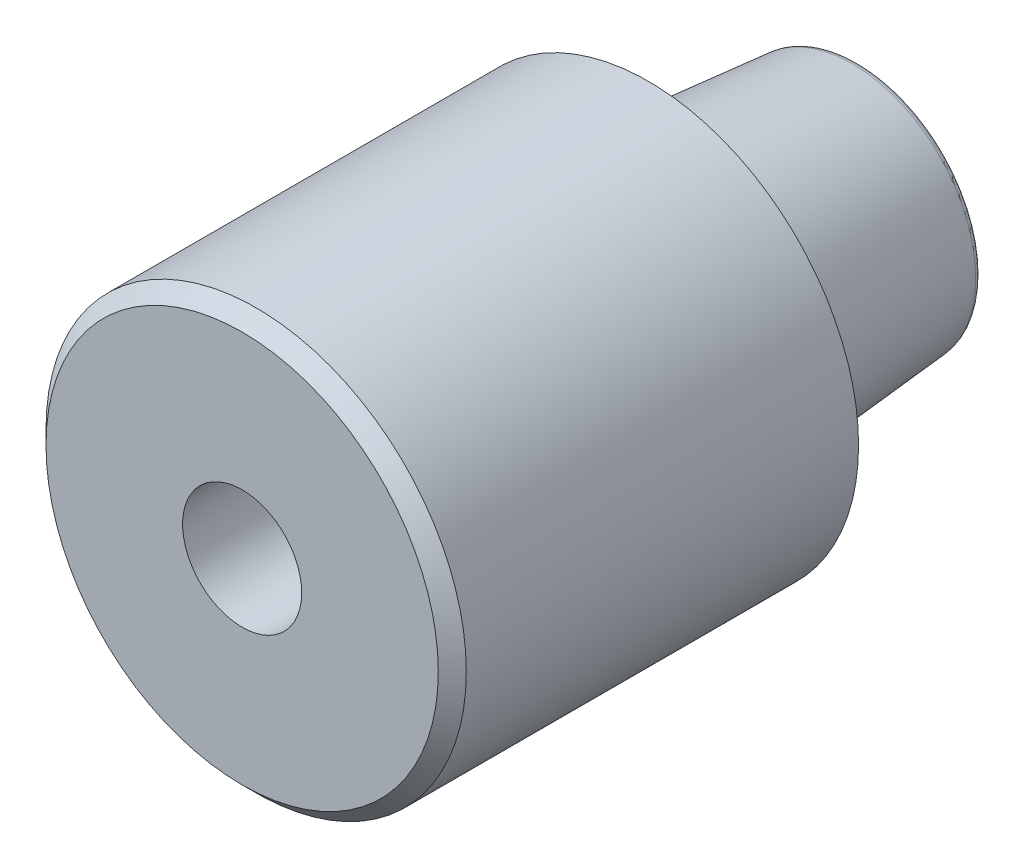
ISO-10303-21;
HEADER;
FILE_DESCRIPTION(('STEP AP214'),'2;1');
FILE_NAME('part.step','',(''),(''),'','','');
FILE_SCHEMA(('AUTOMOTIVE_DESIGN { 1 0 10303 214 1 1 1 1 }'));
ENDSEC;
DATA;
#1=APPLICATION_CONTEXT('core data for automotive mechanical design processes');
#2=APPLICATION_PROTOCOL_DEFINITION('international standard','automotive_design',2000,#1);
#3=PRODUCT_CONTEXT('',#1,'mechanical');
#4=PRODUCT('Part','Part','',(#3));
#5=PRODUCT_RELATED_PRODUCT_CATEGORY('part','',(#4));
#6=PRODUCT_DEFINITION_FORMATION('','',#4);
#7=PRODUCT_DEFINITION_CONTEXT('part definition',#1,'design');
#8=PRODUCT_DEFINITION('design','',#6,#7);
#9=PRODUCT_DEFINITION_SHAPE('','',#8);
#10=(LENGTH_UNIT() NAMED_UNIT(*) SI_UNIT(.MILLI.,.METRE.));
#11=(NAMED_UNIT(*) PLANE_ANGLE_UNIT() SI_UNIT($,.RADIAN.));
#12=(NAMED_UNIT(*) SI_UNIT($,.STERADIAN.) SOLID_ANGLE_UNIT());
#13=UNCERTAINTY_MEASURE_WITH_UNIT(LENGTH_MEASURE(1.E-05),#10,'distance_accuracy_value','');
#14=(GEOMETRIC_REPRESENTATION_CONTEXT(3) GLOBAL_UNCERTAINTY_ASSIGNED_CONTEXT((#13)) GLOBAL_UNIT_ASSIGNED_CONTEXT((#10,
#11,#12)) REPRESENTATION_CONTEXT('',''));
#15=CARTESIAN_POINT('',(0.,0.,0.));
#16=DIRECTION('',(0.,0.,1.));
#17=DIRECTION('',(1.,0.,0.));
#18=AXIS2_PLACEMENT_3D('',#15,#16,#17);
#19=CARTESIAN_POINT('',(1.5911934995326E-13,0.,22.7867965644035));
#20=DIRECTION('',(0.,0.,-1.));
#21=DIRECTION('',(1.,0.,0.));
#22=AXIS2_PLACEMENT_3D('',#19,#20,#21);
#23=CONICAL_SURFACE('',#22,21.2132034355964,0.785398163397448);
#24=CARTESIAN_POINT('',(2.09488880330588E-13,0.,30.));
#25=DIRECTION('',(0.,0.,-1.));
#26=DIRECTION('',(-1.,0.,0.));
#27=AXIS2_PLACEMENT_3D('',#24,#25,#26);
#28=CIRCLE('',#27,14.);
#29=CARTESIAN_POINT('',(-13.9999999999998,0.,30.));
#30=VERTEX_POINT('',#29);
#31=CARTESIAN_POINT('',(14.0000000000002,0.,30.));
#32=VERTEX_POINT('',#31);
#33=EDGE_CURVE('E59',#30,#32,#28,.T.);
#34=ORIENTED_EDGE('',*,*,#33,.T.);
#35=CARTESIAN_POINT('',(14.0000009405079,0.,29.9999990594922));
#36=CARTESIAN_POINT('',(15.0000023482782,0.,28.9999976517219));
#37=B_SPLINE_CURVE_WITH_KNOTS('',1,(#35,#36),.UNSPECIFIED.,.F.,.F.,(2,2),(0.659966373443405,
0.707106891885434),.UNSPECIFIED.);
#38=CARTESIAN_POINT('',(15.,0.,29.));
#39=VERTEX_POINT('',#38);
#40=EDGE_CURVE('E46',#32,#39,#37,.T.);
#41=ORIENTED_EDGE('',*,*,#40,.T.);
#42=CARTESIAN_POINT('',(2.02505917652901E-13,0.,29.));
#43=DIRECTION('',(0.,0.,1.));
#44=DIRECTION('',(-1.,0.,0.));
#45=AXIS2_PLACEMENT_3D('',#42,#43,#44);
#46=CIRCLE('',#45,15.);
#47=CARTESIAN_POINT('',(-14.9999999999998,0.,29.));
#48=VERTEX_POINT('',#47);
#49=EDGE_CURVE('E97',#39,#48,#46,.T.);
#50=ORIENTED_EDGE('',*,*,#49,.T.);
#51=CARTESIAN_POINT('',(2.02505917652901E-13,0.,29.));
#52=DIRECTION('',(0.,0.,1.));
#53=DIRECTION('',(-1.,0.,0.));
#54=AXIS2_PLACEMENT_3D('',#51,#52,#53);
#55=CIRCLE('',#54,15.);
#56=EDGE_CURVE('E11',#48,#39,#55,.T.);
#57=ORIENTED_EDGE('',*,*,#56,.T.);
#58=ORIENTED_EDGE('',*,*,#40,.F.);
#59=CARTESIAN_POINT('',(2.09488880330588E-13,0.,30.));
#60=DIRECTION('',(0.,0.,-1.));
#61=DIRECTION('',(-1.,0.,0.));
#62=AXIS2_PLACEMENT_3D('',#59,#60,#61);
#63=CIRCLE('',#62,14.);
#64=EDGE_CURVE('E94',#32,#30,#63,.T.);
#65=ORIENTED_EDGE('',*,*,#64,.T.);
#66=EDGE_LOOP('',(#34,#41,#50,#57,#58,#65));
#67=FACE_BOUND('',#66,.T.);
#68=ADVANCED_FACE('F38',(#67),#23,.T.);
#69=CARTESIAN_POINT('',(1.08235921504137E-13,0.,15.5));
#70=DIRECTION('',(0.,0.,-1.));
#71=DIRECTION('',(-1.,0.,0.));
#72=AXIS2_PLACEMENT_3D('',#69,#70,#71);
#73=CYLINDRICAL_SURFACE('',#72,15.);
#74=ORIENTED_EDGE('',*,*,#49,.F.);
#75=ORIENTED_EDGE('',*,*,#56,.F.);
#76=CARTESIAN_POINT('',(-14.9999999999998,0.,29.0000010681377));
#77=CARTESIAN_POINT('',(-15.,0.,1.00000036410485));
#78=B_SPLINE_CURVE_WITH_KNOTS('',1,(#76,#77),.UNSPECIFIED.,.F.,.F.,(2,2),(0.0833333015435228,
0.916666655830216),.UNSPECIFIED.);
#79=CARTESIAN_POINT('',(-15.,0.,1.0000000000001));
#80=VERTEX_POINT('',#79);
#81=EDGE_CURVE('E132',#48,#80,#78,.T.);
#82=ORIENTED_EDGE('',*,*,#81,.T.);
#83=CARTESIAN_POINT('',(0.,0.,1.));
#84=DIRECTION('',(0.,0.,-1.));
#85=DIRECTION('',(-1.,0.,0.));
#86=AXIS2_PLACEMENT_3D('',#83,#84,#85);
#87=CIRCLE('',#86,15.);
#88=EDGE_CURVE('E137',#80,#80,#87,.T.);
#89=ORIENTED_EDGE('',*,*,#88,.F.);
#90=ORIENTED_EDGE('',*,*,#81,.F.);
#91=EDGE_LOOP('',(#74,#75,#82,#89,#90));
#92=FACE_BOUND('',#91,.T.);
#93=ADVANCED_FACE('F182',(#92),#73,.T.);
#94=CARTESIAN_POINT('',(-18.2,-29.0984535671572,30.));
#95=DIRECTION('',(0.,0.,1.));
#96=DIRECTION('',(1.,0.,0.));
#97=AXIS2_PLACEMENT_3D('',#94,#95,#96);
#98=PLANE('',#97);
#99=CARTESIAN_POINT('',(0.,0.,29.9999999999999));
#100=DIRECTION('',(0.,0.,1.));
#101=DIRECTION('',(1.,0.,0.));
#102=AXIS2_PLACEMENT_3D('',#99,#100,#101);
#103=CIRCLE('',#102,4.24999999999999);
#104=CARTESIAN_POINT('',(4.24999999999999,0.,29.9999999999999));
#105=VERTEX_POINT('',#104);
#106=EDGE_CURVE('E95',#105,#105,#103,.T.);
#107=ORIENTED_EDGE('',*,*,#106,.F.);
#108=EDGE_LOOP('',(#107));
#109=FACE_BOUND('',#108,.T.);
#110=ORIENTED_EDGE('',*,*,#64,.F.);
#111=ORIENTED_EDGE('',*,*,#33,.F.);
#112=EDGE_LOOP('',(#110,#111));
#113=FACE_BOUND('',#112,.T.);
#114=ADVANCED_FACE('F185',(#109,#113),#98,.T.);
#115=CARTESIAN_POINT('',(0.,0.,-13.5));
#116=DIRECTION('',(0.,0.,-1.));
#117=DIRECTION('',(-1.,0.,0.));
#118=AXIS2_PLACEMENT_3D('',#115,#116,#117);
#119=TOROIDAL_SURFACE('',#118,8.31699312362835,0.5);
#120=CARTESIAN_POINT('',(0.,0.,-13.5435778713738));
#121=DIRECTION('',(0.,0.,-1.));
#122=DIRECTION('',(-1.,0.,0.));
#123=AXIS2_PLACEMENT_3D('',#120,#121,#122);
#124=CIRCLE('',#123,8.81509047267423);
#125=CARTESIAN_POINT('',(-8.81509047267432,0.,-13.5435778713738));
#126=VERTEX_POINT('',#125);
#127=EDGE_CURVE('E138',#126,#126,#124,.T.);
#128=ORIENTED_EDGE('',*,*,#127,.T.);
#129=CARTESIAN_POINT('',(-8.81509047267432,0.,-13.5435778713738));
#130=CARTESIAN_POINT('',(-8.77515871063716,0.,-13.9999999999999));
#131=CARTESIAN_POINT('',(-8.31699312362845,0.,-14.));
#132=(BOUNDED_CURVE() B_SPLINE_CURVE(2,(#129,#130,#131),.UNSPECIFIED.,.F.,
.F.) B_SPLINE_CURVE_WITH_KNOTS((3,3),(0.,0.5),
.UNSPECIFIED.) CURVE() GEOMETRIC_REPRESENTATION_ITEM() RATIONAL_B_SPLINE_CURVE((1.,
0.737277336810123,1.)) REPRESENTATION_ITEM(''));
#133=CARTESIAN_POINT('',(-8.31699312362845,0.,-14.));
#134=VERTEX_POINT('',#133);
#135=EDGE_CURVE('E121',#126,#134,#132,.T.);
#136=ORIENTED_EDGE('',*,*,#135,.T.);
#137=CARTESIAN_POINT('',(0.,0.,-14.));
#138=DIRECTION('',(0.,0.,1.));
#139=DIRECTION('',(-1.,0.,0.));
#140=AXIS2_PLACEMENT_3D('',#137,#138,#139);
#141=CIRCLE('',#140,8.31699312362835);
#142=EDGE_CURVE('E127',#134,#134,#141,.T.);
#143=ORIENTED_EDGE('',*,*,#142,.T.);
#144=ORIENTED_EDGE('',*,*,#135,.F.);
#145=EDGE_LOOP('',(#128,#136,#143,#144));
#146=FACE_BOUND('',#145,.T.);
#147=ADVANCED_FACE('F187',(#146),#119,.T.);
#148=CARTESIAN_POINT('',(0.,0.,0.));
#149=DIRECTION('',(0.,0.,1.));
#150=DIRECTION('',(-1.,0.,0.));
#151=AXIS2_PLACEMENT_3D('',#148,#149,#150);
#152=CONICAL_SURFACE('',#151,10.,0.0872664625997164);
#153=ORIENTED_EDGE('',*,*,#127,.F.);
#154=CARTESIAN_POINT('',(-8.81509047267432,0.,-13.5435778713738));
#155=CARTESIAN_POINT('',(-10.,0.,0.));
#156=B_SPLINE_CURVE_WITH_KNOTS('',1,(#154,#155),.UNSPECIFIED.,.F.,.F.,(2,2),(0.,1.),.UNSPECIFIED.);
#157=CARTESIAN_POINT('',(-10.,0.,0.));
#158=VERTEX_POINT('',#157);
#159=EDGE_CURVE('E110',#126,#158,#156,.T.);
#160=ORIENTED_EDGE('',*,*,#159,.T.);
#161=CARTESIAN_POINT('',(0.,0.,0.));
#162=DIRECTION('',(0.,0.,-1.));
#163=DIRECTION('',(-1.,0.,0.));
#164=AXIS2_PLACEMENT_3D('',#161,#162,#163);
#165=CIRCLE('',#164,10.);
#166=EDGE_CURVE('E116',#158,#158,#165,.T.);
#167=ORIENTED_EDGE('',*,*,#166,.T.);
#168=ORIENTED_EDGE('',*,*,#159,.F.);
#169=EDGE_LOOP('',(#153,#160,#167,#168));
#170=FACE_BOUND('',#169,.T.);
#171=ADVANCED_FACE('F194',(#170),#152,.T.);
#172=CARTESIAN_POINT('',(19.1290841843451,-17.2865455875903,-14.0000000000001));
#173=DIRECTION('',(0.,0.,-1.));
#174=DIRECTION('',(-1.,0.,0.));
#175=AXIS2_PLACEMENT_3D('',#172,#173,#174);
#176=PLANE('',#175);
#177=ORIENTED_EDGE('',*,*,#142,.F.);
#178=EDGE_LOOP('',(#177));
#179=FACE_BOUND('',#178,.T.);
#180=ADVANCED_FACE('F222',(#179),#176,.T.);
#181=CARTESIAN_POINT('',(0.,0.,0.5));
#182=DIRECTION('',(0.,0.,-1.));
#183=DIRECTION('',(-1.,0.,0.));
#184=AXIS2_PLACEMENT_3D('',#181,#182,#183);
#185=CYLINDRICAL_SURFACE('',#184,10.);
#186=CARTESIAN_POINT('',(0.,0.,1.));
#187=DIRECTION('',(0.,0.,1.));
#188=DIRECTION('',(-1.,0.,0.));
#189=AXIS2_PLACEMENT_3D('',#186,#187,#188);
#190=CIRCLE('',#189,10.);
#191=CARTESIAN_POINT('',(-10.,0.,1.00000000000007));
#192=VERTEX_POINT('',#191);
#193=EDGE_CURVE('E105',#192,#192,#190,.T.);
#194=ORIENTED_EDGE('',*,*,#193,.F.);
#195=CARTESIAN_POINT('',(-10.,0.,1.00000305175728));
#196=CARTESIAN_POINT('',(-10.,0.,5.31746945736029E-07));
#197=B_SPLINE_CURVE_WITH_KNOTS('',1,(#195,#196),.UNSPECIFIED.,.F.,.F.,(2,2),(0.0833307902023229,
0.91666622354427),.UNSPECIFIED.);
#198=EDGE_CURVE('E102',#192,#158,#197,.T.);
#199=ORIENTED_EDGE('',*,*,#198,.T.);
#200=ORIENTED_EDGE('',*,*,#166,.F.);
#201=ORIENTED_EDGE('',*,*,#198,.F.);
#202=EDGE_LOOP('',(#194,#199,#200,#201));
#203=FACE_BOUND('',#202,.T.);
#204=ADVANCED_FACE('F231',(#203),#185,.T.);
#205=CARTESIAN_POINT('',(34.5,-31.1769145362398,0.999999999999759));
#206=DIRECTION('',(0.,0.,-1.));
#207=DIRECTION('',(-1.,0.,0.));
#208=AXIS2_PLACEMENT_3D('',#205,#206,#207);
#209=PLANE('',#208);
#210=ORIENTED_EDGE('',*,*,#88,.T.);
#211=EDGE_LOOP('',(#210));
#212=FACE_BOUND('',#211,.T.);
#213=ORIENTED_EDGE('',*,*,#193,.T.);
#214=EDGE_LOOP('',(#213));
#215=FACE_BOUND('',#214,.T.);
#216=ADVANCED_FACE('F88',(#212,#215),#209,.T.);
#217=CARTESIAN_POINT('',(0.,0.,7.99999999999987));
#218=DIRECTION('',(0.,0.,1.));
#219=DIRECTION('',(1.,0.,0.));
#220=AXIS2_PLACEMENT_3D('',#217,#218,#219);
#221=CONICAL_SURFACE('',#220,4.24999999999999,1.02974425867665);
#222=CARTESIAN_POINT('',(0.,0.,5.44634236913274));
#223=VERTEX_POINT('',#222);
#224=VERTEX_LOOP('',#223);
#225=FACE_BOUND('',#224,.T.);
#226=CARTESIAN_POINT('',(0.,0.,7.99999999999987));
#227=DIRECTION('',(0.,0.,1.));
#228=DIRECTION('',(1.,0.,0.));
#229=AXIS2_PLACEMENT_3D('',#226,#227,#228);
#230=CIRCLE('',#229,4.24999999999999);
#231=CARTESIAN_POINT('',(4.24999999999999,0.,7.99999999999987));
#232=VERTEX_POINT('',#231);
#233=EDGE_CURVE('E92',#232,#232,#230,.T.);
#234=ORIENTED_EDGE('',*,*,#233,.T.);
#235=EDGE_LOOP('',(#234));
#236=FACE_BOUND('',#235,.T.);
#237=ADVANCED_FACE('F84',(#225,#236),#221,.F.);
#238=CARTESIAN_POINT('',(0.,0.,29.9999999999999));
#239=DIRECTION('',(0.,0.,1.));
#240=DIRECTION('',(1.,0.,0.));
#241=AXIS2_PLACEMENT_3D('',#238,#239,#240);
#242=CYLINDRICAL_SURFACE('',#241,4.24999999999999);
#243=ORIENTED_EDGE('',*,*,#233,.F.);
#244=EDGE_LOOP('',(#243));
#245=FACE_BOUND('',#244,.T.);
#246=ORIENTED_EDGE('',*,*,#106,.T.);
#247=EDGE_LOOP('',(#246));
#248=FACE_BOUND('',#247,.T.);
#249=ADVANCED_FACE('F87',(#245,#248),#242,.F.);
#250=CLOSED_SHELL('',(#68,#93,#114,#147,#171,#180,#204,#216,#237,#249));
#251=MANIFOLD_SOLID_BREP('B2',#250);
#252=ADVANCED_BREP_SHAPE_REPRESENTATION('',(#18,#251),#14);
#253=SHAPE_DEFINITION_REPRESENTATION(#9,#252);
ENDSEC;
END-ISO-10303-21;
